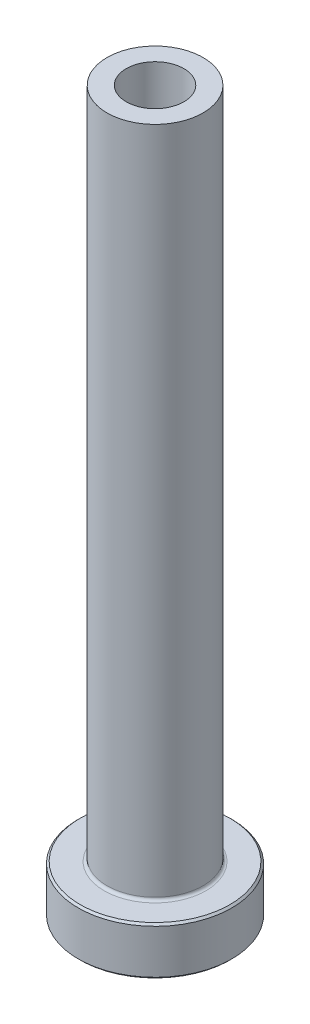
from build123d import *

# Parameters (mm, degrees)
FILLET1_R     = 0.3
CHAMFER1_SIZE = 0.2
CHAMFER3_SIZE = 0.5


with BuildPart() as part:
    # Sketch1 → Revolve1 (revolve)
    with BuildSketch(Plane.XY, mode=Mode.PRIVATE) as revolve1_sk:
        Polygon((-3, 75), (-5, 75), (-5, 5), (-8, 5), (-8, 0), (-3.25, 0), (-3.25, 18), (-3, 30), align=None)
    revolve(revolve1_sk.sketch.rotate(Axis((0, 92.187680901, 0), (0, -1, 0)), 270), axis=Axis((0, 92.187680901, 0), (0, -1, 0)))

    # Fillet1
    fillet1_edges = [part.edges().sort_by_distance(p)[0] for p in [
        (0, 5, -5),
    ]]
    fillet(fillet1_edges, radius=FILLET1_R)

    # Chamfer1
    chamfer1_edges = [part.edges().sort_by_distance(p)[0] for p in [
        (0, 0, -8),
        (0, 5, -8),
    ]]
    chamfer(chamfer1_edges, length=CHAMFER1_SIZE)

    # Chamfer3
    chamfer3_edges = [part.edges().sort_by_distance(p)[0] for p in [
        (0, 0, -3.25),
    ]]
    chamfer(chamfer3_edges, length=CHAMFER3_SIZE)


solid = part.part
